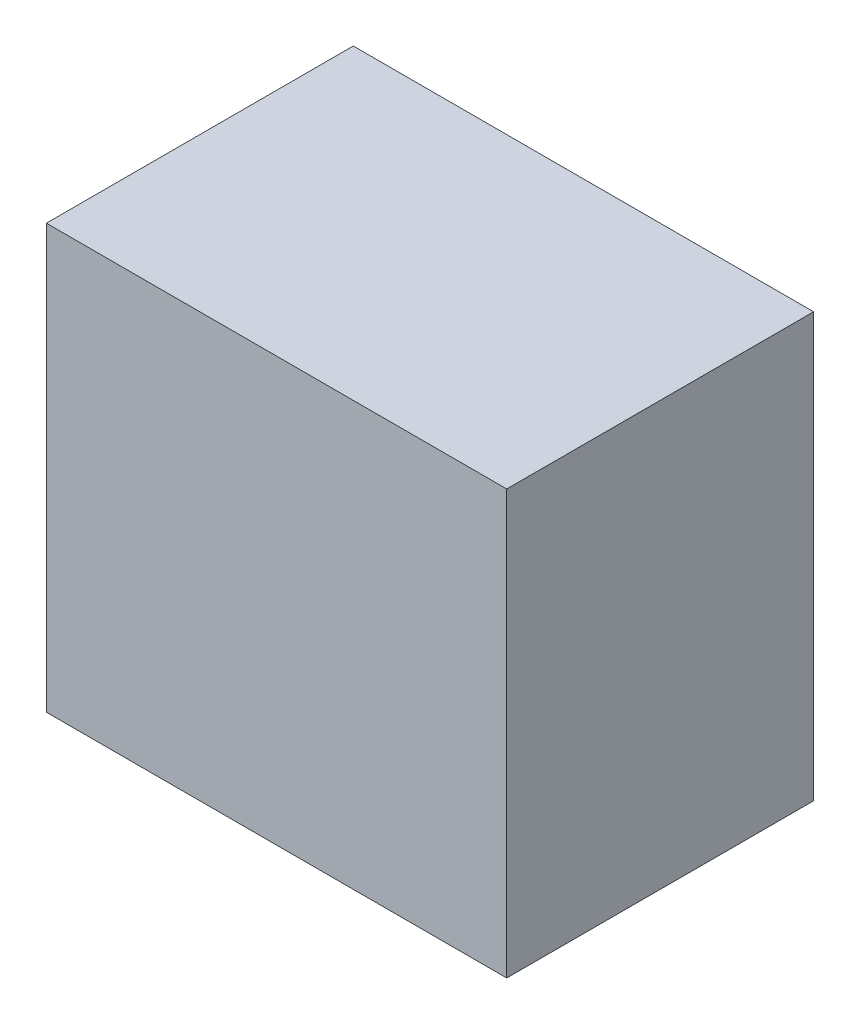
from build123d import *

# Parameters (mm, degrees)
ESQUISSE1_W = 150
ESQUISSE1_H = 100
BASE_DEPTH  = 138


with BuildPart() as part:
    # Esquisse1 → base (new body)
    with BuildSketch(Plane(origin=(0, 0, 0), x_dir=(1, 0, 0), z_dir=(0, 1, 0))):
        with Locations((75, 0)):
            Rectangle(ESQUISSE1_W, ESQUISSE1_H)
    extrude(amount=BASE_DEPTH)


solid = part.part
